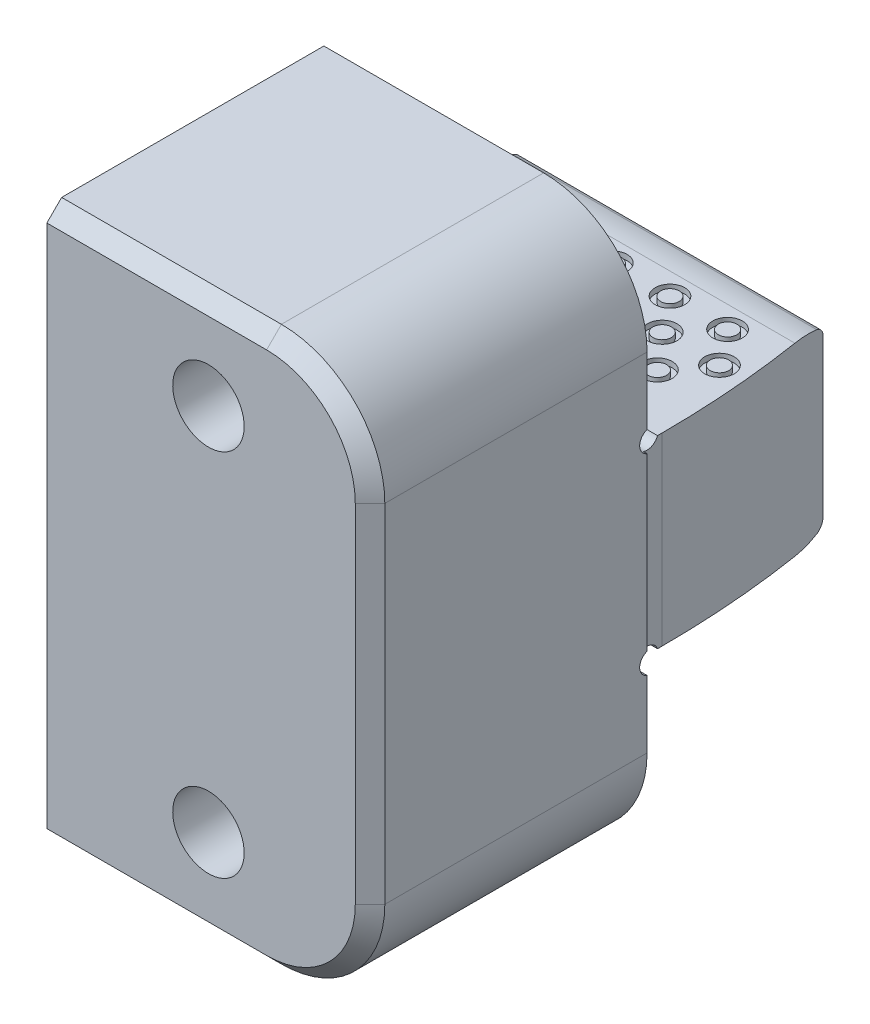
from build123d import *

# Parameters (mm, degrees)
EXTRUDE1_DEPTH        = 11.1125
SKETCH7_W             = 21.968267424
SKETCH7_H             = 31.720833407
CUT_EXTRUDE3_DEPTH    = 0.254
SKETCH8_R             = 0.762
CUT_EXTRUDE4_DEPTH    = 35.925
CUT_EXTRUDE5_DEPTH    = 35.925
CUT_EXTRUDE6_DEPTH    = 45.022723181
SKETCH15_R            = 1.016
SKETCH15_R_2          = 0.635
CUT_EXTRUDE7_DEPTH    = 0.381
F_8_CBORE_D           = 4.9149
F_8_CBORE_CBORE_D     = 7.9375
F_8_CBORE_CBORE_DEPTH = 4.96062
FILLET1_R             = 7.112
CHAMFER1_SIZE         = 1.016


with BuildPart() as part:
    # Sketch3 → Extrude1 (new, symmetric)
    with BuildSketch(Plane(origin=(0, 0, 0), x_dir=(0, 0, -1), z_dir=(1, 0, 0))):
        Polygon((-19.05, -19.05), (0, -19.05), (0, -6.34746), (13.5636, -6.34746), (13.5636, 6.34746), (0, 6.34746), (0, 19.05), (-19.05, 19.05), align=None)
    extrude(amount=EXTRUDE1_DEPTH, both=True)

    # Sketch7 → Cut-Extrude3 (cut)
    with BuildSketch(Plane(origin=(11.1125, 0, 0), x_dir=(0, 0, -1), z_dir=(1, 0, 0))):
        with Locations((10.984133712, 1.307835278)):
            Rectangle(SKETCH7_W, SKETCH7_H)
    extrude(amount=-CUT_EXTRUDE3_DEPTH, mode=Mode.SUBTRACT)

    # Sketch8 → Cut-Extrude4 (cut, through all)
    with BuildSketch(Plane(origin=(11.1125, 0, 0), x_dir=(0, 0, -1), z_dir=(1, 0, 0))):
        with Locations((0.254, 6.60146)):
            Circle(SKETCH8_R)
        with Locations((0.254, -6.60146)):
            Circle(SKETCH8_R)
    extrude(amount=-CUT_EXTRUDE4_DEPTH, mode=Mode.SUBTRACT)

    # Sketch9 → Cut-Extrude5 (cut, through all)
    with BuildSketch(Plane(origin=(11.1125, 0, 0), x_dir=(0, 0, -1), z_dir=(1, 0, 0))):
        with BuildLine():
            Line((13.5636, 5.351440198), (17.5514, 5.351440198))
            Line((17.5514, 5.351440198), (17.5514, 11.701440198))
            Line((17.5514, 11.701440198), (11.2014, 11.701440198))
            Line((11.2014, 11.701440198), (11.2014, 6.34746))
            ThreePointArc((11.2014, 6.34746), (12.12027584, 6.28062538), (13.019809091, 6.081528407))
            ThreePointArc((13.019809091, 6.081528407), (13.412713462, 5.806615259), (13.5636, 5.351440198))
        make_face()
        with BuildLine():
            Line((17.5514, -5.351440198), (17.5514, -11.701440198))
            Line((17.5514, -11.701440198), (11.2014, -11.701440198))
            Line((11.2014, -11.701440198), (11.2014, -6.34746))
            ThreePointArc((11.2014, -6.34746), (12.12027584, -6.28062538), (13.019809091, -6.081528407))
            ThreePointArc((13.019809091, -6.081528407), (13.412713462, -5.806615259), (13.5636, -5.351440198))
            Line((13.5636, -5.351440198), (17.5514, -5.351440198))
        make_face()
    extrude(amount=-CUT_EXTRUDE5_DEPTH, mode=Mode.SUBTRACT)

    # Sketch13 → Cut-Extrude6 (cut, through all)
    with BuildSketch(Plane(origin=(0, 19.05, 0), x_dir=(1, 0, 0), z_dir=(0, 1, 0))):
        with BuildLine():
            Line((9.575539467, 13.97), (22.275539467, 13.97))
            Line((22.275539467, 13.97), (22.275539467, 1.27))
            Line((22.275539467, 1.27), (10.8585, 1.27))
            ThreePointArc((10.8585, 1.27), (10.536945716, 7.652319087), (9.575539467, 13.97))
        make_face()
    extrude(amount=-CUT_EXTRUDE6_DEPTH, mode=Mode.SUBTRACT)

    # Sketch15 → Cut-Extrude7 (cut)
    # profile 1 of 15: a face of its own
    with BuildSketch(Plane(origin=(0, 6.34746, 0), x_dir=(1, 0, 0), z_dir=(0, 1, 0))):
        with Locations(Location((-4.9403, 9.7028, 0), (0, 0, 270))):
            Circle(SKETCH15_R)
        with Locations(Location((-4.9403, 9.7028, 0), (0, 0, 270))):
            Circle(SKETCH15_R_2, mode=Mode.SUBTRACT)
    # profile 2 of 15: a face of its own
    with BuildSketch(Plane(origin=(0, 6.34746, 0), x_dir=(1, 0, 0), z_dir=(0, 1, 0))):
        with Locations(Location((-0.9779, 9.7028, 0), (0, 0, 270))):
            Circle(SKETCH15_R)
        with Locations(Location((-0.9779, 9.7028, 0), (0, 0, 270))):
            Circle(SKETCH15_R_2, mode=Mode.SUBTRACT)
    # profile 3 of 15: a face of its own
    with BuildSketch(Plane(origin=(0, 6.34746, 0), x_dir=(1, 0, 0), z_dir=(0, 1, 0))):
        with Locations(Location((-8.9027, 9.7028, 0), (0, 0, 270))):
            Circle(SKETCH15_R)
        with Locations(Location((-8.9027, 9.7028, 0), (0, 0, 270))):
            Circle(SKETCH15_R_2, mode=Mode.SUBTRACT)
    # profile 4 of 15: a face of its own
    with BuildSketch(Plane(origin=(0, 6.34746, 0), x_dir=(1, 0, 0), z_dir=(0, 1, 0))):
        with Locations(Location((2.9845, 9.7028, 0), (0, 0, 270))):
            Circle(SKETCH15_R)
        with Locations(Location((2.9845, 9.7028, 0), (0, 0, 270))):
            Circle(SKETCH15_R_2, mode=Mode.SUBTRACT)
    # profile 5 of 15: a face of its own
    with BuildSketch(Plane(origin=(0, 6.34746, 0), x_dir=(1, 0, 0), z_dir=(0, 1, 0))):
        with Locations(Location((6.9469, 9.7028, 0), (0, 0, 270))):
            Circle(SKETCH15_R)
        with Locations(Location((6.9469, 9.7028, 0), (0, 0, 270))):
            Circle(SKETCH15_R_2, mode=Mode.SUBTRACT)
    # profile 6 of 15: a face of its own
    with BuildSketch(Plane(origin=(0, 6.34746, 0), x_dir=(1, 0, 0), z_dir=(0, 1, 0))):
        with Locations(Location((-3.0099, 7.2898, 0), (0, 0, 270))):
            Circle(SKETCH15_R)
        with Locations(Location((-3.0099, 7.2898, 0), (0, 0, 270))):
            Circle(SKETCH15_R_2, mode=Mode.SUBTRACT)
    # profile 7 of 15: a face of its own
    with BuildSketch(Plane(origin=(0, 6.34746, 0), x_dir=(1, 0, 0), z_dir=(0, 1, 0))):
        with Locations(Location((0.9271, 7.2898, 0), (0, 0, 270))):
            Circle(SKETCH15_R)
        with Locations(Location((0.9271, 7.2898, 0), (0, 0, 270))):
            Circle(SKETCH15_R_2, mode=Mode.SUBTRACT)
    # profile 8 of 15: a face of its own
    with BuildSketch(Plane(origin=(0, 6.34746, 0), x_dir=(1, 0, 0), z_dir=(0, 1, 0))):
        with Locations(Location((-6.9469, 7.2898, 0), (0, 0, 270))):
            Circle(SKETCH15_R)
        with Locations(Location((-6.9469, 7.2898, 0), (0, 0, 270))):
            Circle(SKETCH15_R_2, mode=Mode.SUBTRACT)
    # profile 9 of 15: a face of its own
    with BuildSketch(Plane(origin=(0, 6.34746, 0), x_dir=(1, 0, 0), z_dir=(0, 1, 0))):
        with Locations(Location((4.8641, 7.2898, 0), (0, 0, 270))):
            Circle(SKETCH15_R)
        with Locations(Location((4.8641, 7.2898, 0), (0, 0, 270))):
            Circle(SKETCH15_R_2, mode=Mode.SUBTRACT)
    # profile 10 of 15: a face of its own
    with BuildSketch(Plane(origin=(0, 6.34746, 0), x_dir=(1, 0, 0), z_dir=(0, 1, 0))):
        with Locations(Location((8.8011, 7.2898, 0), (0, 0, 270))):
            Circle(SKETCH15_R)
        with Locations(Location((8.8011, 7.2898, 0), (0, 0, 270))):
            Circle(SKETCH15_R_2, mode=Mode.SUBTRACT)
    # profile 11 of 15: a face of its own
    with BuildSketch(Plane(origin=(0, 6.34746, 0), x_dir=(1, 0, 0), z_dir=(0, 1, 0))):
        with Locations(Location((-4.9403, 4.8768, 0), (0, 0, 270))):
            Circle(SKETCH15_R)
        with Locations(Location((-4.9403, 4.8768, 0), (0, 0, 270))):
            Circle(SKETCH15_R_2, mode=Mode.SUBTRACT)
    # profile 12 of 15: a face of its own
    with BuildSketch(Plane(origin=(0, 6.34746, 0), x_dir=(1, 0, 0), z_dir=(0, 1, 0))):
        with Locations(Location((-0.9779, 4.8768, 0), (0, 0, 270))):
            Circle(SKETCH15_R)
        with Locations(Location((-0.9779, 4.8768, 0), (0, 0, 270))):
            Circle(SKETCH15_R_2, mode=Mode.SUBTRACT)
    # profile 13 of 15: a face of its own
    with BuildSketch(Plane(origin=(0, 6.34746, 0), x_dir=(1, 0, 0), z_dir=(0, 1, 0))):
        with Locations(Location((-8.9027, 4.8768, 0), (0, 0, 270))):
            Circle(SKETCH15_R)
        with Locations(Location((-8.9027, 4.8768, 0), (0, 0, 270))):
            Circle(SKETCH15_R_2, mode=Mode.SUBTRACT)
    # profile 14 of 15: a face of its own
    with BuildSketch(Plane(origin=(0, 6.34746, 0), x_dir=(1, 0, 0), z_dir=(0, 1, 0))):
        with Locations(Location((2.9845, 4.8768, 0), (0, 0, 270))):
            Circle(SKETCH15_R)
        with Locations(Location((2.9845, 4.8768, 0), (0, 0, 270))):
            Circle(SKETCH15_R_2, mode=Mode.SUBTRACT)
    # profile 15 of 15: a face of its own
    with BuildSketch(Plane(origin=(0, 6.34746, 0), x_dir=(1, 0, 0), z_dir=(0, 1, 0))):
        with Locations(Location((6.9469, 4.8768, 0), (0, 0, 270))):
            Circle(SKETCH15_R)
        with Locations(Location((6.9469, 4.8768, 0), (0, 0, 270))):
            Circle(SKETCH15_R_2, mode=Mode.SUBTRACT)
    cut_extrude7 = extrude(amount=-CUT_EXTRUDE7_DEPTH, mode=Mode.SUBTRACT)

    # Mirror1: Cut-Extrude7 across plane
    add(cut_extrude7.mirror(Plane.ZX), mode=Mode.SUBTRACT)

    # 8 CBORE (through all)
    with Locations(Plane(origin=(0, 0, 0), x_dir=(-1, 0, 0), z_dir=(0, 0, -1))):
        with Locations((0, 12.7), (0, -12.7)):
            CounterBoreHole(F_8_CBORE_D / 2, F_8_CBORE_CBORE_D / 2, F_8_CBORE_CBORE_DEPTH)

    # Fillet1
    fillet1_edges = [part.edges().sort_by_distance(p)[0] for p in [
        (11.1125, 19.05, 9.525),
        (11.1125, -19.05, 9.525),
    ]]
    fillet(fillet1_edges, radius=FILLET1_R)

    # Chamfer1
    chamfer1_edges = [part.edges().sort_by_distance(p)[0] for p in [
        (11.1125, 0, 19.05),
        (-3.556, -19.05, 19.05),
        (-3.556, 19.05, 19.05),
        (9.029443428, 16.966943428, 19.05),
        (9.029443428, -16.966943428, 19.05),
    ]]
    chamfer(chamfer1_edges, length=CHAMFER1_SIZE)


solid = part.part
